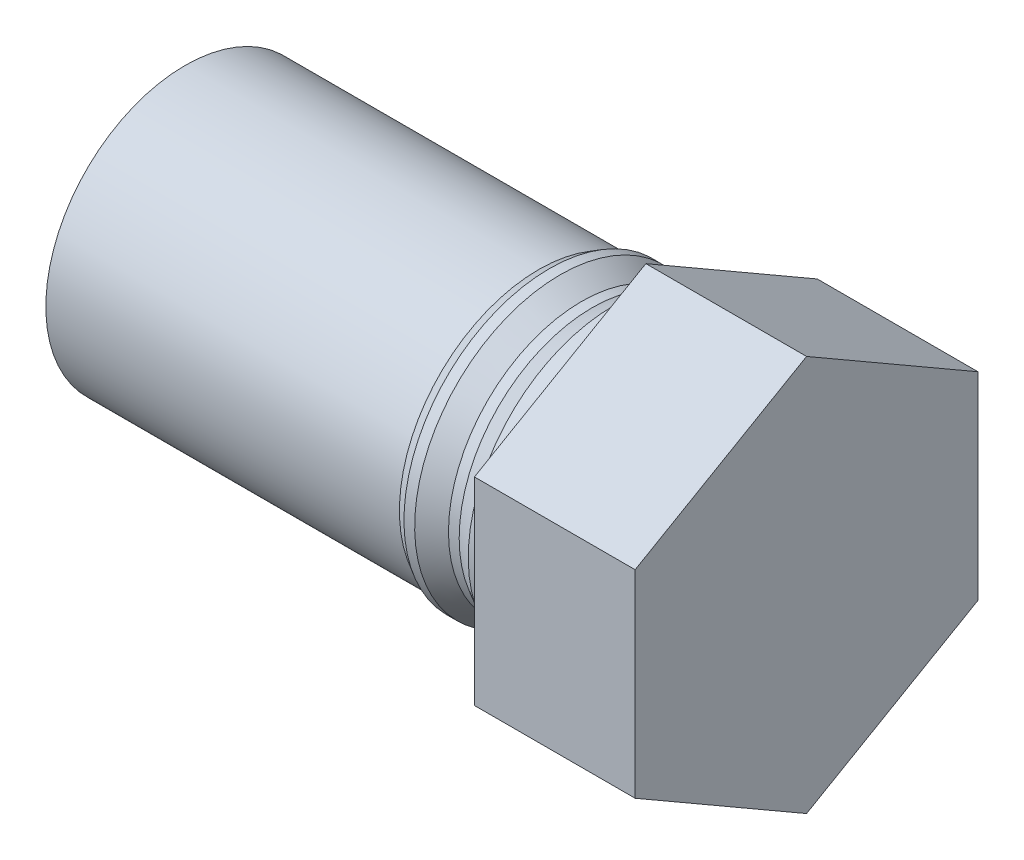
ISO-10303-21;
HEADER;
FILE_DESCRIPTION(('STEP AP214'),'2;1');
FILE_NAME('part.step','',(''),(''),'','','');
FILE_SCHEMA(('AUTOMOTIVE_DESIGN { 1 0 10303 214 1 1 1 1 }'));
ENDSEC;
DATA;
#1=APPLICATION_CONTEXT('core data for automotive mechanical design processes');
#2=APPLICATION_PROTOCOL_DEFINITION('international standard','automotive_design',2000,#1);
#3=PRODUCT_CONTEXT('',#1,'mechanical');
#4=PRODUCT('Part','Part','',(#3));
#5=PRODUCT_RELATED_PRODUCT_CATEGORY('part','',(#4));
#6=PRODUCT_DEFINITION_FORMATION('','',#4);
#7=PRODUCT_DEFINITION_CONTEXT('part definition',#1,'design');
#8=PRODUCT_DEFINITION('design','',#6,#7);
#9=PRODUCT_DEFINITION_SHAPE('','',#8);
#10=(LENGTH_UNIT() NAMED_UNIT(*) SI_UNIT(.MILLI.,.METRE.));
#11=(NAMED_UNIT(*) PLANE_ANGLE_UNIT() SI_UNIT($,.RADIAN.));
#12=(NAMED_UNIT(*) SI_UNIT($,.STERADIAN.) SOLID_ANGLE_UNIT());
#13=UNCERTAINTY_MEASURE_WITH_UNIT(LENGTH_MEASURE(1.E-05),#10,'distance_accuracy_value','');
#14=(GEOMETRIC_REPRESENTATION_CONTEXT(3) GLOBAL_UNCERTAINTY_ASSIGNED_CONTEXT((#13)) GLOBAL_UNIT_ASSIGNED_CONTEXT((#10,
#11,#12)) REPRESENTATION_CONTEXT('',''));
#15=CARTESIAN_POINT('',(0.,0.,0.));
#16=DIRECTION('',(0.,0.,1.));
#17=DIRECTION('',(1.,0.,0.));
#18=AXIS2_PLACEMENT_3D('',#15,#16,#17);
#19=CARTESIAN_POINT('',(0.,0.,0.));
#20=DIRECTION('',(-1.,0.,0.));
#21=DIRECTION('',(0.,-1.,0.));
#22=AXIS2_PLACEMENT_3D('',#19,#20,#21);
#23=PLANE('',#22);
#24=CARTESIAN_POINT('',(0.,0.,0.));
#25=DIRECTION('',(1.,0.,0.));
#26=DIRECTION('',(0.,1.,0.));
#27=AXIS2_PLACEMENT_3D('',#24,#25,#26);
#28=CIRCLE('',#27,13.);
#29=CARTESIAN_POINT('',(0.,13.,0.));
#30=VERTEX_POINT('',#29);
#31=EDGE_CURVE('E11',#30,#30,#28,.T.);
#32=ORIENTED_EDGE('',*,*,#31,.F.);
#33=EDGE_LOOP('',(#32));
#34=FACE_BOUND('',#33,.T.);
#35=ADVANCED_FACE('F33',(#34),#23,.T.);
#36=CARTESIAN_POINT('',(43.,0.,0.));
#37=DIRECTION('',(1.,0.,0.));
#38=DIRECTION('',(0.,1.,0.));
#39=AXIS2_PLACEMENT_3D('',#36,#37,#38);
#40=CYLINDRICAL_SURFACE('',#39,13.);
#41=ORIENTED_EDGE('',*,*,#31,.T.);
#42=EDGE_LOOP('',(#41));
#43=FACE_BOUND('',#42,.T.);
#44=CARTESIAN_POINT('',(33.,0.,0.));
#45=DIRECTION('',(1.,0.,0.));
#46=DIRECTION('',(0.,1.,0.));
#47=AXIS2_PLACEMENT_3D('',#44,#45,#46);
#48=CIRCLE('',#47,13.);
#49=CARTESIAN_POINT('',(33.,13.,0.));
#50=VERTEX_POINT('',#49);
#51=EDGE_CURVE('E41',#50,#50,#48,.T.);
#52=ORIENTED_EDGE('',*,*,#51,.F.);
#53=EDGE_LOOP('',(#52));
#54=FACE_BOUND('',#53,.T.);
#55=ADVANCED_FACE('F160',(#43,#54),#40,.T.);
#56=CARTESIAN_POINT('',(34.,0.,0.));
#57=DIRECTION('',(1.,0.,0.));
#58=DIRECTION('',(0.,1.,0.));
#59=AXIS2_PLACEMENT_3D('',#56,#57,#58);
#60=CONICAL_SURFACE('',#59,13.5773502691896,0.5235987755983);
#61=ORIENTED_EDGE('',*,*,#51,.T.);
#62=EDGE_LOOP('',(#61));
#63=FACE_BOUND('',#62,.T.);
#64=CARTESIAN_POINT('',(34.,0.,0.));
#65=DIRECTION('',(1.,0.,0.));
#66=DIRECTION('',(0.,1.,0.));
#67=AXIS2_PLACEMENT_3D('',#64,#65,#66);
#68=CIRCLE('',#67,13.5773502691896);
#69=CARTESIAN_POINT('',(34.,13.5773502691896,0.));
#70=VERTEX_POINT('',#69);
#71=EDGE_CURVE('E152',#70,#70,#68,.T.);
#72=ORIENTED_EDGE('',*,*,#71,.F.);
#73=EDGE_LOOP('',(#72));
#74=FACE_BOUND('',#73,.T.);
#75=ADVANCED_FACE('F157',(#63,#74),#60,.T.);
#76=CARTESIAN_POINT('',(43.,0.,0.));
#77=DIRECTION('',(1.,0.,0.));
#78=DIRECTION('',(0.,1.,0.));
#79=AXIS2_PLACEMENT_3D('',#76,#77,#78);
#80=CYLINDRICAL_SURFACE('',#79,13.5773502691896);
#81=ORIENTED_EDGE('',*,*,#71,.T.);
#82=EDGE_LOOP('',(#81));
#83=FACE_BOUND('',#82,.T.);
#84=CARTESIAN_POINT('',(35.,0.,0.));
#85=DIRECTION('',(1.,0.,0.));
#86=DIRECTION('',(0.,1.,0.));
#87=AXIS2_PLACEMENT_3D('',#84,#85,#86);
#88=CIRCLE('',#87,13.5773502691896);
#89=CARTESIAN_POINT('',(35.,13.5773502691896,0.));
#90=VERTEX_POINT('',#89);
#91=EDGE_CURVE('E149',#90,#90,#88,.T.);
#92=ORIENTED_EDGE('',*,*,#91,.F.);
#93=EDGE_LOOP('',(#92));
#94=FACE_BOUND('',#93,.T.);
#95=ADVANCED_FACE('F167',(#83,#94),#80,.T.);
#96=CARTESIAN_POINT('',(37.,0.,0.));
#97=DIRECTION('',(-1.,0.,0.));
#98=DIRECTION('',(0.,-1.,0.));
#99=AXIS2_PLACEMENT_3D('',#96,#97,#98);
#100=CONICAL_SURFACE('',#99,12.4226497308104,0.523598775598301);
#101=ORIENTED_EDGE('',*,*,#91,.T.);
#102=EDGE_LOOP('',(#101));
#103=FACE_BOUND('',#102,.T.);
#104=CARTESIAN_POINT('',(37.,0.,0.));
#105=DIRECTION('',(1.,0.,0.));
#106=DIRECTION('',(0.,1.,0.));
#107=AXIS2_PLACEMENT_3D('',#104,#105,#106);
#108=CIRCLE('',#107,12.4226497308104);
#109=CARTESIAN_POINT('',(37.,12.4226497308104,0.));
#110=VERTEX_POINT('',#109);
#111=EDGE_CURVE('E146',#110,#110,#108,.T.);
#112=ORIENTED_EDGE('',*,*,#111,.F.);
#113=EDGE_LOOP('',(#112));
#114=FACE_BOUND('',#113,.T.);
#115=ADVANCED_FACE('F173',(#103,#114),#100,.T.);
#116=CARTESIAN_POINT('',(43.,0.,0.));
#117=DIRECTION('',(1.,0.,0.));
#118=DIRECTION('',(0.,1.,0.));
#119=AXIS2_PLACEMENT_3D('',#116,#117,#118);
#120=CYLINDRICAL_SURFACE('',#119,12.4226497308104);
#121=ORIENTED_EDGE('',*,*,#111,.T.);
#122=EDGE_LOOP('',(#121));
#123=FACE_BOUND('',#122,.T.);
#124=CARTESIAN_POINT('',(38.,0.,0.));
#125=DIRECTION('',(1.,0.,0.));
#126=DIRECTION('',(0.,1.,0.));
#127=AXIS2_PLACEMENT_3D('',#124,#125,#126);
#128=CIRCLE('',#127,12.4226497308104);
#129=CARTESIAN_POINT('',(38.,12.4226497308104,0.));
#130=VERTEX_POINT('',#129);
#131=EDGE_CURVE('E143',#130,#130,#128,.T.);
#132=ORIENTED_EDGE('',*,*,#131,.F.);
#133=EDGE_LOOP('',(#132));
#134=FACE_BOUND('',#133,.T.);
#135=ADVANCED_FACE('F177',(#123,#134),#120,.T.);
#136=CARTESIAN_POINT('',(40.,0.,0.));
#137=DIRECTION('',(1.,0.,0.));
#138=DIRECTION('',(0.,1.,0.));
#139=AXIS2_PLACEMENT_3D('',#136,#137,#138);
#140=CONICAL_SURFACE('',#139,13.5773502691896,0.523598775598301);
#141=ORIENTED_EDGE('',*,*,#131,.T.);
#142=EDGE_LOOP('',(#141));
#143=FACE_BOUND('',#142,.T.);
#144=CARTESIAN_POINT('',(40.,0.,0.));
#145=DIRECTION('',(1.,0.,0.));
#146=DIRECTION('',(0.,1.,0.));
#147=AXIS2_PLACEMENT_3D('',#144,#145,#146);
#148=CIRCLE('',#147,13.5773502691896);
#149=CARTESIAN_POINT('',(40.,13.5773502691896,0.));
#150=VERTEX_POINT('',#149);
#151=EDGE_CURVE('E140',#150,#150,#148,.T.);
#152=ORIENTED_EDGE('',*,*,#151,.F.);
#153=EDGE_LOOP('',(#152));
#154=FACE_BOUND('',#153,.T.);
#155=ADVANCED_FACE('F181',(#143,#154),#140,.T.);
#156=CARTESIAN_POINT('',(43.,0.,0.));
#157=DIRECTION('',(1.,0.,0.));
#158=DIRECTION('',(0.,1.,0.));
#159=AXIS2_PLACEMENT_3D('',#156,#157,#158);
#160=CYLINDRICAL_SURFACE('',#159,13.5773502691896);
#161=ORIENTED_EDGE('',*,*,#151,.T.);
#162=EDGE_LOOP('',(#161));
#163=FACE_BOUND('',#162,.T.);
#164=CARTESIAN_POINT('',(43.,0.,0.));
#165=DIRECTION('',(1.,0.,0.));
#166=DIRECTION('',(0.,1.,0.));
#167=AXIS2_PLACEMENT_3D('',#164,#165,#166);
#168=CIRCLE('',#167,13.5773502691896);
#169=CARTESIAN_POINT('',(43.,13.5773502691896,0.));
#170=VERTEX_POINT('',#169);
#171=EDGE_CURVE('E137',#170,#170,#168,.T.);
#172=ORIENTED_EDGE('',*,*,#171,.F.);
#173=EDGE_LOOP('',(#172));
#174=FACE_BOUND('',#173,.T.);
#175=ADVANCED_FACE('F185',(#163,#174),#160,.T.);
#176=CARTESIAN_POINT('',(58.,9.23760430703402,-16.));
#177=DIRECTION('',(0.,-0.866025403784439,0.5));
#178=DIRECTION('',(0.,-0.5,-0.866025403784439));
#179=AXIS2_PLACEMENT_3D('',#176,#177,#178);
#180=PLANE('',#179);
#181=DIRECTION('',(0.,0.5,0.866025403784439));
#182=VECTOR('',#181,1.);
#183=CARTESIAN_POINT('',(43.,9.23760430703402,-16.));
#184=LINE('',#183,#182);
#185=CARTESIAN_POINT('',(43.,9.23760430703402,-16.));
#186=VERTEX_POINT('',#185);
#187=CARTESIAN_POINT('',(43.,18.475208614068,0.));
#188=VERTEX_POINT('',#187);
#189=EDGE_CURVE('E118',#186,#188,#184,.T.);
#190=ORIENTED_EDGE('',*,*,#189,.T.);
#191=DIRECTION('',(-1.,0.,0.));
#192=VECTOR('',#191,1.);
#193=CARTESIAN_POINT('',(58.,18.475208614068,0.));
#194=LINE('',#193,#192);
#195=CARTESIAN_POINT('',(58.,18.475208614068,0.));
#196=VERTEX_POINT('',#195);
#197=EDGE_CURVE('E135',#196,#188,#194,.T.);
#198=ORIENTED_EDGE('',*,*,#197,.F.);
#199=DIRECTION('',(0.,0.5,0.866025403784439));
#200=VECTOR('',#199,1.);
#201=CARTESIAN_POINT('',(58.,9.23760430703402,-16.));
#202=LINE('',#201,#200);
#203=CARTESIAN_POINT('',(58.,9.23760430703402,-16.));
#204=VERTEX_POINT('',#203);
#205=EDGE_CURVE('E128',#204,#196,#202,.T.);
#206=ORIENTED_EDGE('',*,*,#205,.F.);
#207=DIRECTION('',(-1.,0.,0.));
#208=VECTOR('',#207,1.);
#209=CARTESIAN_POINT('',(58.,9.23760430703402,-16.));
#210=LINE('',#209,#208);
#211=EDGE_CURVE('E114',#204,#186,#210,.T.);
#212=ORIENTED_EDGE('',*,*,#211,.T.);
#213=EDGE_LOOP('',(#190,#198,#206,#212));
#214=FACE_BOUND('',#213,.T.);
#215=ADVANCED_FACE('F189',(#214),#180,.F.);
#216=CARTESIAN_POINT('',(58.,18.475208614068,0.));
#217=DIRECTION('',(0.,-0.866025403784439,-0.5));
#218=DIRECTION('',(0.,0.5,-0.866025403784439));
#219=AXIS2_PLACEMENT_3D('',#216,#217,#218);
#220=PLANE('',#219);
#221=DIRECTION('',(0.,-0.5,0.866025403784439));
#222=VECTOR('',#221,1.);
#223=CARTESIAN_POINT('',(43.,18.475208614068,0.));
#224=LINE('',#223,#222);
#225=CARTESIAN_POINT('',(43.,9.23760430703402,16.));
#226=VERTEX_POINT('',#225);
#227=EDGE_CURVE('E121',#188,#226,#224,.T.);
#228=ORIENTED_EDGE('',*,*,#227,.T.);
#229=DIRECTION('',(-1.,0.,0.));
#230=VECTOR('',#229,1.);
#231=CARTESIAN_POINT('',(58.,9.23760430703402,16.));
#232=LINE('',#231,#230);
#233=CARTESIAN_POINT('',(58.,9.23760430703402,16.));
#234=VERTEX_POINT('',#233);
#235=EDGE_CURVE('E132',#234,#226,#232,.T.);
#236=ORIENTED_EDGE('',*,*,#235,.F.);
#237=DIRECTION('',(0.,-0.5,0.866025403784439));
#238=VECTOR('',#237,1.);
#239=CARTESIAN_POINT('',(58.,18.475208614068,0.));
#240=LINE('',#239,#238);
#241=EDGE_CURVE('E87',#196,#234,#240,.T.);
#242=ORIENTED_EDGE('',*,*,#241,.F.);
#243=ORIENTED_EDGE('',*,*,#197,.T.);
#244=EDGE_LOOP('',(#228,#236,#242,#243));
#245=FACE_BOUND('',#244,.T.);
#246=ADVANCED_FACE('F193',(#245),#220,.F.);
#247=CARTESIAN_POINT('',(58.,9.23760430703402,16.));
#248=DIRECTION('',(0.,0.,-1.));
#249=DIRECTION('',(-1.,0.,0.));
#250=AXIS2_PLACEMENT_3D('',#247,#248,#249);
#251=PLANE('',#250);
#252=DIRECTION('',(0.,-1.,0.));
#253=VECTOR('',#252,1.);
#254=CARTESIAN_POINT('',(43.,9.23760430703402,16.));
#255=LINE('',#254,#253);
#256=CARTESIAN_POINT('',(43.,-9.23760430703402,16.));
#257=VERTEX_POINT('',#256);
#258=EDGE_CURVE('E123',#226,#257,#255,.T.);
#259=ORIENTED_EDGE('',*,*,#258,.T.);
#260=DIRECTION('',(-1.,0.,0.));
#261=VECTOR('',#260,1.);
#262=CARTESIAN_POINT('',(58.,-9.23760430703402,16.));
#263=LINE('',#262,#261);
#264=CARTESIAN_POINT('',(58.,-9.23760430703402,16.));
#265=VERTEX_POINT('',#264);
#266=EDGE_CURVE('E109',#265,#257,#263,.T.);
#267=ORIENTED_EDGE('',*,*,#266,.F.);
#268=DIRECTION('',(0.,-1.,0.));
#269=VECTOR('',#268,1.);
#270=CARTESIAN_POINT('',(58.,9.23760430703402,16.));
#271=LINE('',#270,#269);
#272=EDGE_CURVE('E100',#234,#265,#271,.T.);
#273=ORIENTED_EDGE('',*,*,#272,.F.);
#274=ORIENTED_EDGE('',*,*,#235,.T.);
#275=EDGE_LOOP('',(#259,#267,#273,#274));
#276=FACE_BOUND('',#275,.T.);
#277=ADVANCED_FACE('F197',(#276),#251,.F.);
#278=CARTESIAN_POINT('',(58.,-9.23760430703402,16.));
#279=DIRECTION('',(0.,0.866025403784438,-0.5));
#280=DIRECTION('',(0.,0.5,0.866025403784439));
#281=AXIS2_PLACEMENT_3D('',#278,#279,#280);
#282=PLANE('',#281);
#283=DIRECTION('',(0.,-0.5,-0.866025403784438));
#284=VECTOR('',#283,1.);
#285=CARTESIAN_POINT('',(43.,-9.23760430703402,16.));
#286=LINE('',#285,#284);
#287=CARTESIAN_POINT('',(43.,-18.475208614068,0.));
#288=VERTEX_POINT('',#287);
#289=EDGE_CURVE('E108',#257,#288,#286,.T.);
#290=ORIENTED_EDGE('',*,*,#289,.T.);
#291=DIRECTION('',(-1.,0.,0.));
#292=VECTOR('',#291,1.);
#293=CARTESIAN_POINT('',(58.,-18.475208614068,0.));
#294=LINE('',#293,#292);
#295=CARTESIAN_POINT('',(58.,-18.475208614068,0.));
#296=VERTEX_POINT('',#295);
#297=EDGE_CURVE('E105',#296,#288,#294,.T.);
#298=ORIENTED_EDGE('',*,*,#297,.F.);
#299=DIRECTION('',(0.,-0.5,-0.866025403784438));
#300=VECTOR('',#299,1.);
#301=CARTESIAN_POINT('',(58.,-9.23760430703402,16.));
#302=LINE('',#301,#300);
#303=EDGE_CURVE('E94',#265,#296,#302,.T.);
#304=ORIENTED_EDGE('',*,*,#303,.F.);
#305=ORIENTED_EDGE('',*,*,#266,.T.);
#306=EDGE_LOOP('',(#290,#298,#304,#305));
#307=FACE_BOUND('',#306,.T.);
#308=ADVANCED_FACE('F106',(#307),#282,.F.);
#309=CARTESIAN_POINT('',(58.,-18.475208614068,0.));
#310=DIRECTION('',(0.,0.866025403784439,0.5));
#311=DIRECTION('',(0.,-0.5,0.866025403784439));
#312=AXIS2_PLACEMENT_3D('',#309,#310,#311);
#313=PLANE('',#312);
#314=DIRECTION('',(0.,0.5,-0.866025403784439));
#315=VECTOR('',#314,1.);
#316=CARTESIAN_POINT('',(43.,-18.475208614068,0.));
#317=LINE('',#316,#315);
#318=CARTESIAN_POINT('',(43.,-9.23760430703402,-16.));
#319=VERTEX_POINT('',#318);
#320=EDGE_CURVE('E72',#288,#319,#317,.T.);
#321=ORIENTED_EDGE('',*,*,#320,.T.);
#322=DIRECTION('',(-1.,0.,0.));
#323=VECTOR('',#322,1.);
#324=CARTESIAN_POINT('',(58.,-9.23760430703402,-16.));
#325=LINE('',#324,#323);
#326=CARTESIAN_POINT('',(58.,-9.23760430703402,-16.));
#327=VERTEX_POINT('',#326);
#328=EDGE_CURVE('E110',#327,#319,#325,.T.);
#329=ORIENTED_EDGE('',*,*,#328,.F.);
#330=DIRECTION('',(0.,0.5,-0.866025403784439));
#331=VECTOR('',#330,1.);
#332=CARTESIAN_POINT('',(58.,-18.475208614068,0.));
#333=LINE('',#332,#331);
#334=EDGE_CURVE('E98',#296,#327,#333,.T.);
#335=ORIENTED_EDGE('',*,*,#334,.F.);
#336=ORIENTED_EDGE('',*,*,#297,.T.);
#337=EDGE_LOOP('',(#321,#329,#335,#336));
#338=FACE_BOUND('',#337,.T.);
#339=ADVANCED_FACE('F112',(#338),#313,.F.);
#340=CARTESIAN_POINT('',(58.,-9.23760430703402,-16.));
#341=DIRECTION('',(0.,0.,1.));
#342=DIRECTION('',(0.,-1.,0.));
#343=AXIS2_PLACEMENT_3D('',#340,#341,#342);
#344=PLANE('',#343);
#345=DIRECTION('',(0.,1.,0.));
#346=VECTOR('',#345,1.);
#347=CARTESIAN_POINT('',(43.,-9.23760430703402,-16.));
#348=LINE('',#347,#346);
#349=EDGE_CURVE('E78',#319,#186,#348,.T.);
#350=ORIENTED_EDGE('',*,*,#349,.T.);
#351=ORIENTED_EDGE('',*,*,#211,.F.);
#352=DIRECTION('',(0.,1.,0.));
#353=VECTOR('',#352,1.);
#354=CARTESIAN_POINT('',(58.,-9.23760430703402,-16.));
#355=LINE('',#354,#353);
#356=EDGE_CURVE('E49',#327,#204,#355,.T.);
#357=ORIENTED_EDGE('',*,*,#356,.F.);
#358=ORIENTED_EDGE('',*,*,#328,.T.);
#359=EDGE_LOOP('',(#350,#351,#357,#358));
#360=FACE_BOUND('',#359,.T.);
#361=ADVANCED_FACE('F205',(#360),#344,.F.);
#362=CARTESIAN_POINT('',(58.,0.,0.));
#363=DIRECTION('',(1.,0.,0.));
#364=DIRECTION('',(0.,0.,-1.));
#365=AXIS2_PLACEMENT_3D('',#362,#363,#364);
#366=PLANE('',#365);
#367=ORIENTED_EDGE('',*,*,#205,.T.);
#368=ORIENTED_EDGE('',*,*,#241,.T.);
#369=ORIENTED_EDGE('',*,*,#272,.T.);
#370=ORIENTED_EDGE('',*,*,#303,.T.);
#371=ORIENTED_EDGE('',*,*,#334,.T.);
#372=ORIENTED_EDGE('',*,*,#356,.T.);
#373=EDGE_LOOP('',(#367,#368,#369,#370,#371,#372));
#374=FACE_BOUND('',#373,.T.);
#375=ADVANCED_FACE('F96',(#374),#366,.T.);
#376=CARTESIAN_POINT('',(43.,0.,0.));
#377=DIRECTION('',(1.,0.,0.));
#378=DIRECTION('',(0.,0.,-1.));
#379=AXIS2_PLACEMENT_3D('',#376,#377,#378);
#380=PLANE('',#379);
#381=ORIENTED_EDGE('',*,*,#171,.T.);
#382=EDGE_LOOP('',(#381));
#383=FACE_BOUND('',#382,.T.);
#384=ORIENTED_EDGE('',*,*,#189,.F.);
#385=ORIENTED_EDGE('',*,*,#349,.F.);
#386=ORIENTED_EDGE('',*,*,#320,.F.);
#387=ORIENTED_EDGE('',*,*,#289,.F.);
#388=ORIENTED_EDGE('',*,*,#258,.F.);
#389=ORIENTED_EDGE('',*,*,#227,.F.);
#390=EDGE_LOOP('',(#384,#385,#386,#387,#388,#389));
#391=FACE_BOUND('',#390,.T.);
#392=ADVANCED_FACE('F208',(#383,#391),#380,.F.);
#393=CLOSED_SHELL('',(#35,#55,#75,#95,#115,#135,#155,#175,#215,#246,#277,#308,#339,#361,#375,#392));
#394=MANIFOLD_SOLID_BREP('B2',#393);
#395=ADVANCED_BREP_SHAPE_REPRESENTATION('',(#18,#394),#14);
#396=SHAPE_DEFINITION_REPRESENTATION(#9,#395);
ENDSEC;
END-ISO-10303-21;
